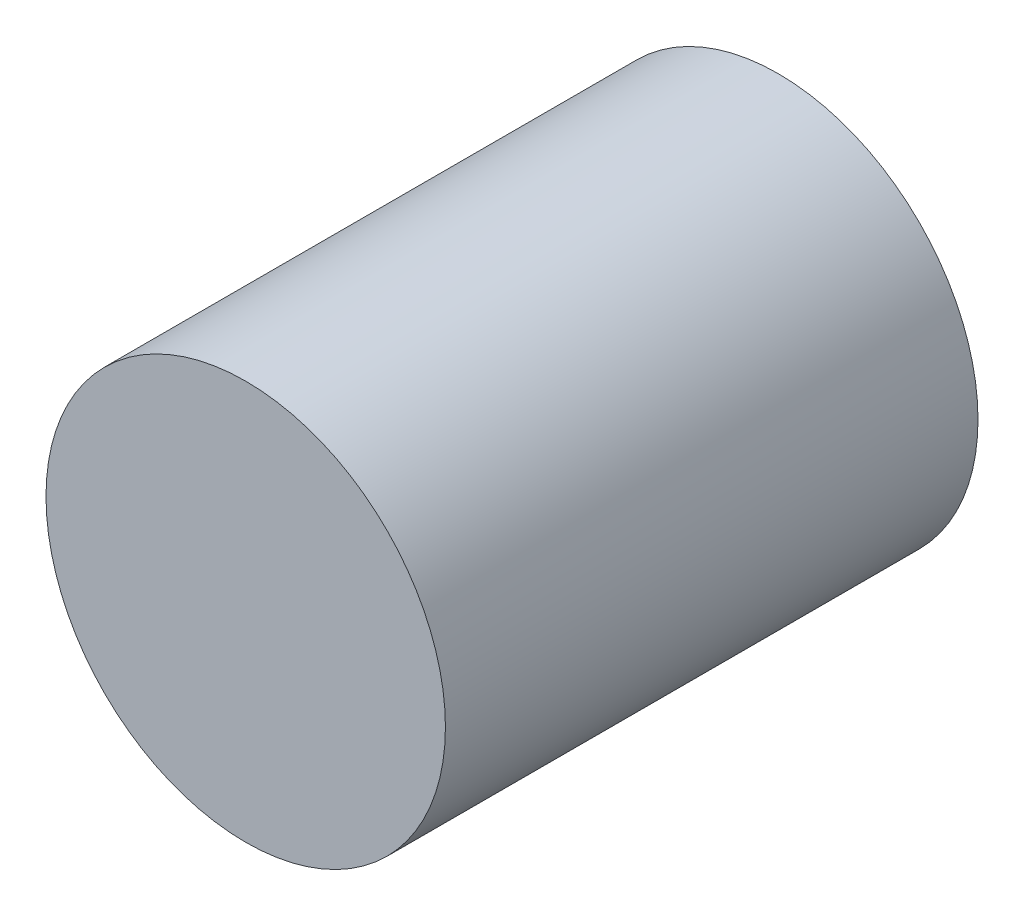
from build123d import *

# Parameters (mm, degrees)
SKETCH1_R          = 4.7625
BASE_EXTRUDE_DEPTH = 12.7


with BuildPart() as part:
    # Sketch1 → Base-Extrude (new body)
    with BuildSketch(Plane.XY):
        Circle(SKETCH1_R)
    extrude(amount=BASE_EXTRUDE_DEPTH)


solid = part.part
